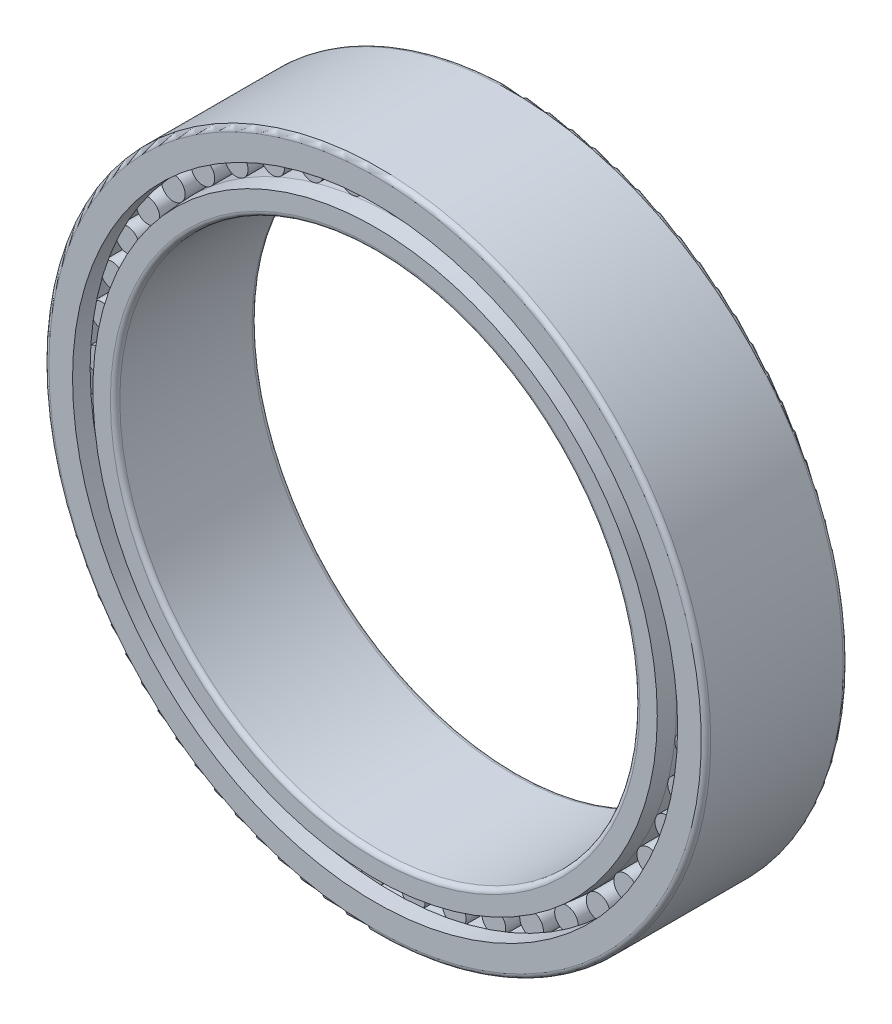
from build123d import *

# Parameters (mm, degrees)
BASESKE_W            = 22.5
BASESKE_H            = 2.5
FILLET1_R            = 1
CIRPATTERNBALL_COUNT = 45


with BuildPart() as part:
    # BaseSke → Roller (revolve)
    with BuildSketch(Plane(origin=(0, 0, 0), x_dir=(0, 0, -1), z_dir=(1, 0, 0)), mode=Mode.PRIVATE) as roller_sk:
        with Locations((0, 61.25)):
            Rectangle(BASESKE_W, BASESKE_H)
    roller = revolve(roller_sk.sketch.rotate(Axis((0, 62.5, 11.25), (0, 0, -1)), 270), axis=Axis((0, 62.5, 11.25), (0, 0, -1)))

    # OuterRaceSke → OuterRace (revolve)
    with BuildSketch(Plane(origin=(0, 0, 0), x_dir=(0, 0, -1), z_dir=(1, 0, 0)), mode=Mode.PRIVATE) as outerrace_sk:
        Polygon((-15, 70), (15, 70), (15, 64), (11.275, 64), (11.275, 64.98), (-11.275, 64.98), (-11.275, 64), (-15, 64), align=None)
    revolve(outerrace_sk.sketch.rotate(Axis((0, 0, 50.391616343), (0, 0, -1)), 90), axis=Axis((0, 0, 50.391616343), (0, 0, -1)))

    # InnerRaceSke → InnerRace (revolve)
    with BuildSketch(Plane(origin=(0, 0, 0), x_dir=(0, 0, -1), z_dir=(1, 0, 0)), mode=Mode.PRIVATE) as innerrace_sk:
        Polygon((-15, 55), (15, 55), (15, 59.694104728), (11.275, 60.02), (-11.275, 60.02), (-15, 59.694104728), align=None)
    revolve(innerrace_sk.sketch.rotate(Axis((0, 0, 70.862590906), (0, 0, -1)), 90), axis=Axis((0, 0, 70.862590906), (0, 0, -1)))

    # Fillet1
    fillet1_edges = [part.edges().sort_by_distance(p)[0] for p in [
        (-70, 0, 15),
        (-70, 0, -15),
        (-55, 0, -15),
        (-55, 0, 15),
    ]]
    fillet(fillet1_edges, radius=FILLET1_R)

    # CirPatternBall: Roller ×45 about axis
    cirpatternball_axis = Axis((0, 0, 0), (0, 0, 1))
    for i in range(1, CIRPATTERNBALL_COUNT):
        add(roller.rotate(cirpatternball_axis, i * 360 / CIRPATTERNBALL_COUNT))


solid = part.part
